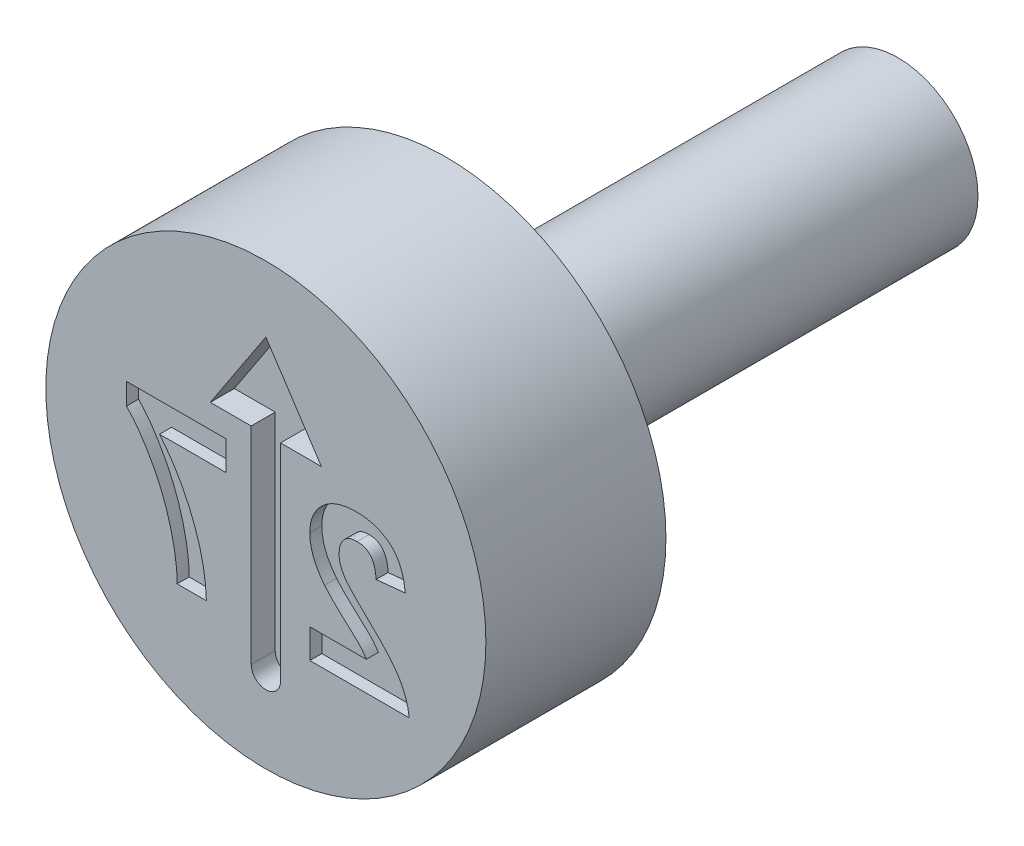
from build123d import *

# Parameters (mm, degrees)
CUT_EXTRUDE4_DEPTH = 0.6
CUT_EXTRUDE5_DEPTH = 0.3


with BuildPart() as part:
    # Sketch2 → Revolve1 (revolve)
    with BuildSketch(Plane(origin=(0, 0, 0), x_dir=(0, 0, -1), z_dir=(1, 0, 0)), mode=Mode.PRIVATE) as revolve1_sk:
        Polygon((0, 5.5), (0, 0), (15.8, 0), (15.8, 2), (4.5, 2), (4.5, 5.5), align=None)
    revolve(revolve1_sk.sketch.rotate(Axis((0, 0, -0.403888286), (0, 0, -1)), 90), axis=Axis((0, 0, -0.403888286), (0, 0, -1)))

    # Sketch3 → Cut-Extrude4 (cut)
    with BuildSketch(Plane.XY):
        with BuildLine():
            Line((0.366422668, 1.743593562), (0.366422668, -3.416891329))
            ThreePointArc((0.366422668, -3.416891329), (0, -3.783313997), (-0.366422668, -3.416891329))
            Line((-0.366422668, -3.416891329), (-0.366422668, 1.743593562))
            Line((-0.366422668, 1.743593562), (-1.388789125, 1.743593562))
            Line((-1.388789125, 1.743593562), (0, 3.851569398))
            Line((0, 3.851569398), (1.388789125, 1.743593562))
            Line((1.388789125, 1.743593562), (0.366422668, 1.743593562))
        make_face()
    extrude(amount=-CUT_EXTRUDE4_DEPTH, mode=Mode.SUBTRACT)

    # Sketch4 → Cut-Extrude5 (cut)
    with BuildSketch(Plane.XY):
        with BuildLine():
            Line((1.098762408, -1.869230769), (1.098762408, -2.6))
            Line((1.098762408, -2.6), (3.583377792, -2.6))
            add(Edge.make_bspline(
                [(3.583377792, -2.6), (3.57496546, -2.537545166), (3.558145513, -2.412670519), (3.50614425, -2.230260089), (3.436740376, -2.052258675), (3.361415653, -1.907408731), (3.286496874, -1.79080951), (3.21852306, -1.695267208), (3.137432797, -1.593614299), (3.044402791, -1.485030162), (2.939947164, -1.369175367), (2.823286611, -1.246480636), (2.693864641, -1.117533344), (2.60281398, -1.029971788), (2.555733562, -0.984695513)],
                knots=[0, 0, 0, 0, 1.156289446, 2.311930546, 3.473459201, 4.661751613, 5.303057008, 6.018253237, 6.81459331, 7.690699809, 8.644447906, 9.679642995, 10.800191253, 12, 12, 12, 12], degree=3))
            add(Edge.make_bspline(
                [(2.555733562, -0.984695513), (2.518162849, -0.948429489), (2.446639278, -0.879389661), (2.344789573, -0.780527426), (2.255253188, -0.689644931), (2.17615804, -0.609097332), (2.109331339, -0.536833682), (2.053894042, -0.473988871), (2.009144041, -0.420306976), (1.984907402, -0.386251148), (1.974163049, -0.371153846)],
                knots=[0, 0, 0, 0, 1.480720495, 2.818855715, 4.024636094, 5.098235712, 6.019786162, 6.815086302, 7.474715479, 8, 8, 8, 8], degree=3))
            add(Edge.make_bspline(
                [(1.974163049, -0.371153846), (1.952161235, -0.334606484), (1.909722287, -0.264110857), (1.863184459, -0.153255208), (1.83525072, -0.042422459), (1.831417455, 0.031635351), (1.829531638, 0.06806891)],
                knots=[0, 0, 0, 0, 1.0911822, 2.104764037, 3.067617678, 4, 4, 4, 4], degree=3))
            add(Edge.make_bspline(
                [(1.829531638, 0.06806891), (1.830900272, 0.105982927), (1.833489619, 0.17771329), (1.855201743, 0.278938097), (1.893704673, 0.365955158), (1.946716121, 0.439031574), (2.013749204, 0.496286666), (2.092112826, 0.538592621), (2.182954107, 0.561982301), (2.246802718, 0.565058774), (2.280172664, 0.566666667)],
                knots=[0, 0, 0, 0, 1.193122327, 2.257294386, 3.237245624, 4.168877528, 5.075331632, 5.990371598, 6.949684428, 8, 8, 8, 8], degree=3))
            add(Edge.make_bspline(
                [(2.280172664, 0.566666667), (2.313317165, 0.565165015), (2.377345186, 0.562264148), (2.468342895, 0.53692257), (2.547949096, 0.493053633), (2.604680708, 0.443060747), (2.643005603, 0.394446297), (2.66911885, 0.352082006), (2.69162643, 0.30394318), (2.711570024, 0.250571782), (2.727323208, 0.191356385), (2.740009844, 0.126747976), (2.750233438, 0.056398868), (2.753484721, 0.007459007), (2.755172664, -0.017948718)],
                knots=[0, 0, 0, 0, 1.402788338, 2.709884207, 3.961032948, 5.225417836, 5.883680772, 6.578928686, 7.329201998, 8.132101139, 8.990263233, 9.922304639, 10.921339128, 12, 12, 12, 12], degree=3))
            Line((2.755172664, -0.017948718), (3.485941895, 0.053605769))
            add(Edge.make_bspline(
                [(3.485941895, 0.053605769), (3.480066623, 0.102941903), (3.468675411, 0.198596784), (3.440248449, 0.335990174), (3.404246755, 0.462741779), (3.358954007, 0.578616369), (3.306242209, 0.684350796), (3.243422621, 0.778358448), (3.172690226, 0.861680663), (3.093983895, 0.934273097), (3.007803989, 0.996366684), (2.917373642, 1.051794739), (2.820925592, 1.097263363), (2.719521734, 1.134736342), (2.613207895, 1.164684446), (2.501492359, 1.184485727), (2.385064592, 1.198414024), (2.305590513, 1.199463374), (2.264948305, 1.2)],
                knots=[0, 0, 0, 0, 1.270971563, 2.464210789, 3.586263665, 4.638946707, 5.643716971, 6.603612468, 7.52484387, 8.434700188, 9.336036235, 10.239171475, 11.145359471, 12.059630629, 13.003312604, 13.96741569, 14.960557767, 16, 16, 16, 16], degree=3))
            add(Edge.make_bspline(
                [(2.264948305, 1.2), (2.220764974, 1.199150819), (2.13471239, 1.197496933), (2.009090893, 1.18383913), (1.891078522, 1.160024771), (1.779643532, 1.128479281), (1.675930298, 1.086363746), (1.579074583, 1.035447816), (1.490600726, 0.973799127), (1.409189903, 0.904779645), (1.336415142, 0.828880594), (1.272671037, 0.747921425), (1.219266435, 0.66195854), (1.174451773, 0.572039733), (1.141177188, 0.47671808), (1.116931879, 0.377311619), (1.100856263, 0.273356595), (1.099468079, 0.202357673), (1.098762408, 0.166266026)],
                knots=[0, 0, 0, 0, 1.210756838, 2.35810096, 3.457354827, 4.507168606, 5.527358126, 6.519769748, 7.499700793, 8.476517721, 9.440526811, 10.376769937, 11.295256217, 12.209626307, 13.124630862, 14.055668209, 15.011616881, 16, 16, 16, 16], degree=3))
            add(Edge.make_bspline(
                [(1.098762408, 0.166266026), (1.09969212, 0.124844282), (1.101536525, 0.042669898), (1.119195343, -0.07880839), (1.146174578, -0.197485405), (1.186047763, -0.313651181), (1.23659012, -0.430092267), (1.30174043, -0.547070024), (1.377384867, -0.668112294), (1.436611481, -0.746371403), (1.467191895, -0.786778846)],
                knots=[0, 0, 0, 0, 0.953409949, 1.89141903, 2.821310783, 3.752688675, 4.715703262, 5.740811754, 6.833515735, 8, 8, 8, 8], degree=3))
            add(Edge.make_bspline(
                [(1.467191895, -0.786778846), (1.478749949, -0.801336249), (1.503504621, -0.832514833), (1.545618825, -0.880322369), (1.594425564, -0.932543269), (1.649235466, -0.990154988), (1.711859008, -1.051117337), (1.780042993, -1.117979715), (1.856787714, -1.187321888), (1.936276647, -1.260873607), (2.016111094, -1.33246046), (2.089490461, -1.400452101), (2.156143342, -1.460610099), (2.212965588, -1.516255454), (2.263299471, -1.563590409), (2.305330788, -1.605042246), (2.339846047, -1.63960745), (2.387405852, -1.693485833), (2.447920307, -1.766356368), (2.4904947, -1.835986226), (2.510821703, -1.869230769)],
                knots=[0, 0, 0, 0, 0.665555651, 1.425465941, 2.280616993, 3.225313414, 4.272635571, 5.410053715, 6.644756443, 7.976022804, 9.288331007, 10.484517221, 11.558462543, 12.503158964, 13.33222979, 14.032602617, 14.617328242, 15.080653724, 16.606167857, 18, 18, 18, 18], degree=3))
            Line((2.510821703, -1.869230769), (1.098762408, -1.869230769))
        make_face()
        with BuildLine():
            Line((-1.000006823, 0.420512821), (-1.000006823, 1.151282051))
            Line((-1.000006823, 1.151282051), (-3.484622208, 1.151282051))
            Line((-3.484622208, 1.151282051), (-3.484622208, 0.615384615))
            add(Edge.make_bspline(
                [(-3.484622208, 0.615384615), (-3.45870298, 0.589012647), (-3.405420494, 0.534799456), (-3.329098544, 0.446074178), (-3.25164578, 0.349791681), (-3.174681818, 0.244654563), (-3.095814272, 0.132323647), (-3.018509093, 0.01064562), (-2.940104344, -0.118800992), (-2.834546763, -0.301903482), (-2.711163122, -0.541091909), (-2.580629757, -0.838415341), (-2.469421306, -1.144869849), (-2.393270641, -1.405991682), (-2.341818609, -1.615280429), (-2.308202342, -1.768317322), (-2.279904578, -1.917047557), (-2.256884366, -2.061732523), (-2.239703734, -2.202438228), (-2.226128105, -2.338675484), (-2.219430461, -2.47077651), (-2.218442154, -2.557365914), (-2.217955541, -2.6)],
                knots=[0, 0, 0, 0, 0.628545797, 1.29210959, 1.98878689, 2.729126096, 3.507039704, 4.322017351, 5.179550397, 6.080149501, 7.915136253, 9.752312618, 11.597470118, 13.454141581, 14.373891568, 15.261584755, 16.117868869, 16.947726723, 17.752002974, 18.527724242, 19.275094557, 20, 20, 20, 20], degree=3))
            Line((-2.217955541, -2.6), (-1.48718631, -2.6))
            add(Edge.make_bspline(
                [(-1.48718631, -2.6), (-1.489629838, -2.535262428), (-1.494544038, -2.405068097), (-1.512930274, -2.209650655), (-1.541807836, -2.013505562), (-1.577675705, -1.816179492), (-1.625030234, -1.618152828), (-1.67907626, -1.418692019), (-1.744544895, -1.218862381), (-1.817933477, -1.019045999), (-1.898950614, -0.82113997), (-1.987247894, -0.627598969), (-2.08259706, -0.439630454), (-2.183758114, -0.256573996), (-2.291907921, -0.0790185), (-2.407127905, 0.092843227), (-2.527783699, 0.260254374), (-2.614054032, 0.367102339), (-2.657178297, 0.420512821)],
                knots=[0, 0, 0, 0, 0.943249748, 1.896978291, 2.856365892, 3.829648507, 4.816416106, 5.820376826, 6.838120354, 7.877341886, 8.919613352, 9.951365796, 10.974227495, 11.988073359, 12.996274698, 14.000568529, 15.000536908, 16, 16, 16, 16], degree=3))
            Line((-2.657178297, 0.420512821), (-1.000006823, 0.420512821))
        make_face()
    extrude(amount=-CUT_EXTRUDE5_DEPTH, mode=Mode.SUBTRACT)


solid = part.part
